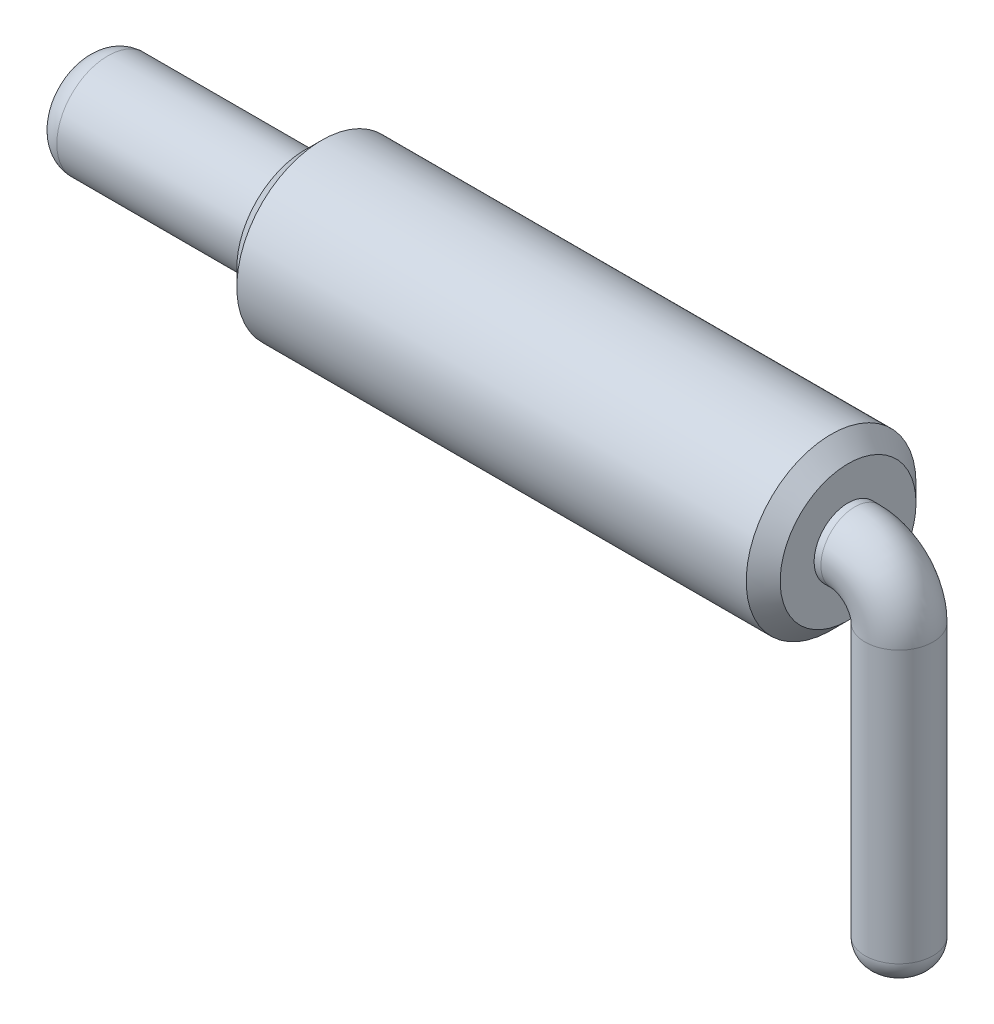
from build123d import *

# Parameters (mm, degrees)
ESQUISSE1_R        = 2.5
BOSS_EXTRU_1_DEPTH = 16
ESQUISSE2_R        = 1.5
BOSS_EXTRU_2_DEPTH = 6.5
ESQUISSE4_R        = 1
CHANFREIN1_SIZE    = 0.5
CONG_1_R           = 0.7


with BuildPart() as part:
    # Esquisse1 → Boss.-Extru.1 (new body)
    with BuildSketch(Plane(origin=(0, 0, 0), x_dir=(0, 0, -1), z_dir=(1, 0, 0))):
        Circle(ESQUISSE1_R)
    extrude(amount=BOSS_EXTRU_1_DEPTH)

    # Esquisse2 → Boss.-Extru.2 (add)
    with BuildSketch(Plane.ZY):
        with Locations(Location((0, 0, 0), (0, 0, 180))):
            Circle(ESQUISSE2_R)
    extrude(amount=BOSS_EXTRU_2_DEPTH)

    # Balayage1: sweep along a path in Esquisse3
    with BuildLine(Plane.XY) as balayage1_path:
        Line((16, 0), (16.2, 0))
        ThreePointArc((16.2, 0), (17.119238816, -0.380761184), (17.5, -1.3))
        Line((17.5, -1.3), (17.5, -10))
    # Esquisse4 → Balayage1 (sweep)
    with BuildSketch(Plane(origin=(17.5, -10, 0), x_dir=(1, 0, 0), z_dir=(0, -1, 0))):
        Circle(ESQUISSE4_R)
    sweep(path=balayage1_path.line)

    # Chanfrein1
    chanfrein1_edges = [part.edges().sort_by_distance(p)[0] for p in [
        (0, 0, 2.5),
        (16, 0, 2.5),
    ]]
    chamfer(chanfrein1_edges, length=CHANFREIN1_SIZE)

    # Cong_1
    cong_1_edges = [part.edges().sort_by_distance(p)[0] for p in [
        (16.5, -10, 0),
        (-6.5, 0, 1.5),
    ]]
    fillet(cong_1_edges, radius=CONG_1_R)


solid = part.part
